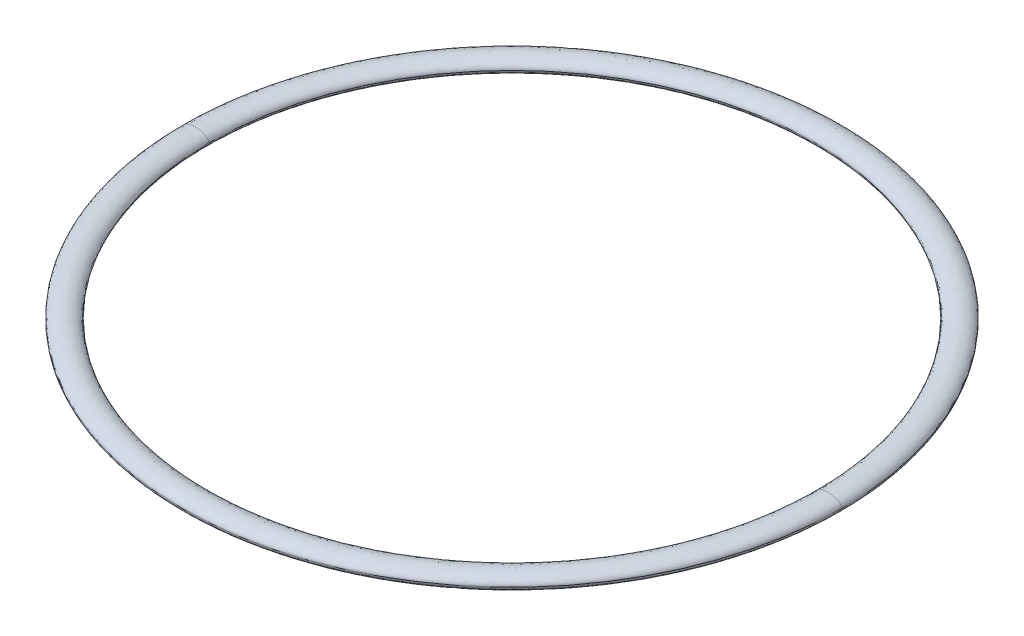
ISO-10303-21;
HEADER;
FILE_DESCRIPTION(('STEP AP214'),'2;1');
FILE_NAME('part.step','',(''),(''),'','','');
FILE_SCHEMA(('AUTOMOTIVE_DESIGN { 1 0 10303 214 1 1 1 1 }'));
ENDSEC;
DATA;
#1=APPLICATION_CONTEXT('core data for automotive mechanical design processes');
#2=APPLICATION_PROTOCOL_DEFINITION('international standard','automotive_design',2000,#1);
#3=PRODUCT_CONTEXT('',#1,'mechanical');
#4=PRODUCT('Part','Part','',(#3));
#5=PRODUCT_RELATED_PRODUCT_CATEGORY('part','',(#4));
#6=PRODUCT_DEFINITION_FORMATION('','',#4);
#7=PRODUCT_DEFINITION_CONTEXT('part definition',#1,'design');
#8=PRODUCT_DEFINITION('design','',#6,#7);
#9=PRODUCT_DEFINITION_SHAPE('','',#8);
#10=(LENGTH_UNIT() NAMED_UNIT(*) SI_UNIT(.MILLI.,.METRE.));
#11=(NAMED_UNIT(*) PLANE_ANGLE_UNIT() SI_UNIT($,.RADIAN.));
#12=(NAMED_UNIT(*) SI_UNIT($,.STERADIAN.) SOLID_ANGLE_UNIT());
#13=UNCERTAINTY_MEASURE_WITH_UNIT(LENGTH_MEASURE(1.E-05),#10,'distance_accuracy_value','');
#14=(GEOMETRIC_REPRESENTATION_CONTEXT(3) GLOBAL_UNCERTAINTY_ASSIGNED_CONTEXT((#13)) GLOBAL_UNIT_ASSIGNED_CONTEXT((#10,
#11,#12)) REPRESENTATION_CONTEXT('',''));
#15=CARTESIAN_POINT('',(0.,0.,0.));
#16=DIRECTION('',(0.,0.,1.));
#17=DIRECTION('',(1.,0.,0.));
#18=AXIS2_PLACEMENT_3D('',#15,#16,#17);
#19=CARTESIAN_POINT('',(31.063768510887,-40.275,0.));
#20=CARTESIAN_POINT('',(31.063768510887,-40.275,62.127537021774));
#21=CARTESIAN_POINT('',(-31.06376851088,-40.275,62.127537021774));
#22=CARTESIAN_POINT('',(-31.06376851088,-40.275,0.));
#23=CARTESIAN_POINT('',(31.063768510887,-41.725,0.));
#24=CARTESIAN_POINT('',(31.063768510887,-41.725,62.127537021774));
#25=CARTESIAN_POINT('',(-31.06376851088,-41.725,62.127537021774));
#26=CARTESIAN_POINT('',(-31.06376851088,-41.725,0.));
#27=CARTESIAN_POINT('',(33.786231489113,-41.725,0.));
#28=CARTESIAN_POINT('',(33.786231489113,-41.725,67.572462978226));
#29=CARTESIAN_POINT('',(-33.78623148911,-41.725,67.572462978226));
#30=CARTESIAN_POINT('',(-33.78623148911,-41.725,0.));
#31=CARTESIAN_POINT('',(33.786231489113,-40.275,0.));
#32=CARTESIAN_POINT('',(33.786231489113,-40.275,67.572462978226));
#33=CARTESIAN_POINT('',(-33.78623148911,-40.275,67.572462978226));
#34=CARTESIAN_POINT('',(-33.78623148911,-40.275,0.));
#35=(BOUNDED_SURFACE() B_SPLINE_SURFACE(3,3,((#19,#20,#21,#22),(#23,#24,#25,#26),(#27,#28,#29,
#30),(#31,#32,#33,#34)),.UNSPECIFIED.,.F.,.F.,.F.) B_SPLINE_SURFACE_WITH_KNOTS((4,4),(4,4),(0.,
1.),(0.,1.),.UNSPECIFIED.) GEOMETRIC_REPRESENTATION_ITEM() RATIONAL_B_SPLINE_SURFACE(((1.,
0.333333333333,0.333333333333,1.),(0.333333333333,0.111111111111,0.111111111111,0.333333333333),
(0.333333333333,0.111111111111,0.111111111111,0.333333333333),(1.,0.333333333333,0.333333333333,1.))) REPRESENTATION_ITEM('') SURFACE());
#36=CARTESIAN_POINT('',(-31.06376851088,-40.275,0.));
#37=CARTESIAN_POINT('',(-31.06376851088,-41.725,0.));
#38=CARTESIAN_POINT('',(-33.78623148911,-41.725,0.));
#39=CARTESIAN_POINT('',(-33.78623148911,-40.275,0.));
#40=(BOUNDED_CURVE() B_SPLINE_CURVE(3,(#36,#37,#38,#39),.UNSPECIFIED.,.F.,
.F.) B_SPLINE_CURVE_WITH_KNOTS((4,4),(3.14159265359,6.28318530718),
.UNSPECIFIED.) CURVE() GEOMETRIC_REPRESENTATION_ITEM() RATIONAL_B_SPLINE_CURVE((1.,
0.333333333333,0.333333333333,1.)) REPRESENTATION_ITEM(''));
#41=CARTESIAN_POINT('',(-31.06376851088,-40.275,0.));
#42=VERTEX_POINT('',#41);
#43=CARTESIAN_POINT('',(-33.78623148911,-40.275,0.));
#44=VERTEX_POINT('',#43);
#45=EDGE_CURVE('E70',#42,#44,#40,.T.);
#46=CARTESIAN_POINT('',(0.,-40.275,0.));
#47=DIRECTION('',(0.,-1.,0.));
#48=DIRECTION('',(1.,0.,0.));
#49=AXIS2_PLACEMENT_3D('',#46,#47,#48);
#50=CIRCLE('',#49,31.063768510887);
#51=CARTESIAN_POINT('',(31.063768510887,-40.275,0.));
#52=VERTEX_POINT('',#51);
#53=EDGE_CURVE('E10',#52,#42,#50,.T.);
#54=CARTESIAN_POINT('',(31.063768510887,-40.275,0.));
#55=CARTESIAN_POINT('',(31.063768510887,-41.725,0.));
#56=CARTESIAN_POINT('',(33.786231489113,-41.725,0.));
#57=CARTESIAN_POINT('',(33.786231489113,-40.275,0.));
#58=(BOUNDED_CURVE() B_SPLINE_CURVE(3,(#54,#55,#56,#57),.UNSPECIFIED.,.F.,
.F.) B_SPLINE_CURVE_WITH_KNOTS((4,4),(3.14159265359,6.28318530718),
.UNSPECIFIED.) CURVE() GEOMETRIC_REPRESENTATION_ITEM() RATIONAL_B_SPLINE_CURVE((1.,
0.333333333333,0.333333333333,1.)) REPRESENTATION_ITEM(''));
#59=CARTESIAN_POINT('',(33.786231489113,-40.275,0.));
#60=VERTEX_POINT('',#59);
#61=EDGE_CURVE('E68',#52,#60,#58,.T.);
#62=CARTESIAN_POINT('',(0.,-40.275,0.));
#63=DIRECTION('',(0.,-1.,0.));
#64=DIRECTION('',(1.,0.,0.));
#65=AXIS2_PLACEMENT_3D('',#62,#63,#64);
#66=CIRCLE('',#65,33.786231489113);
#67=EDGE_CURVE('E28',#60,#44,#66,.T.);
#68=ORIENTED_EDGE('',*,*,#45,.F.);
#69=ORIENTED_EDGE('',*,*,#53,.F.);
#70=ORIENTED_EDGE('',*,*,#61,.T.);
#71=ORIENTED_EDGE('',*,*,#67,.T.);
#72=EDGE_LOOP('',(#68,#69,#70,#71));
#73=FACE_BOUND('',#72,.T.);
#74=ADVANCED_FACE('F16',(#73),#35,.T.);
#75=CARTESIAN_POINT('',(33.786231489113,-40.275,0.));
#76=CARTESIAN_POINT('',(33.786231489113,-40.275,67.572462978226));
#77=CARTESIAN_POINT('',(-33.78623148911,-40.275,67.572462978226));
#78=CARTESIAN_POINT('',(-33.78623148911,-40.275,0.));
#79=CARTESIAN_POINT('',(33.786231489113,-38.825,0.));
#80=CARTESIAN_POINT('',(33.786231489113,-38.825,67.572462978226));
#81=CARTESIAN_POINT('',(-33.78623148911,-38.825,67.572462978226));
#82=CARTESIAN_POINT('',(-33.78623148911,-38.825,0.));
#83=CARTESIAN_POINT('',(31.063768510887,-38.825,0.));
#84=CARTESIAN_POINT('',(31.063768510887,-38.825,62.127537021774));
#85=CARTESIAN_POINT('',(-31.06376851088,-38.825,62.127537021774));
#86=CARTESIAN_POINT('',(-31.06376851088,-38.825,0.));
#87=CARTESIAN_POINT('',(31.063768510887,-40.275,0.));
#88=CARTESIAN_POINT('',(31.063768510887,-40.275,62.127537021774));
#89=CARTESIAN_POINT('',(-31.06376851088,-40.275,62.127537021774));
#90=CARTESIAN_POINT('',(-31.06376851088,-40.275,0.));
#91=(BOUNDED_SURFACE() B_SPLINE_SURFACE(3,3,((#75,#76,#77,#78),(#79,#80,#81,#82),(#83,#84,#85,
#86),(#87,#88,#89,#90)),.UNSPECIFIED.,.F.,.F.,.F.) B_SPLINE_SURFACE_WITH_KNOTS((4,4),(4,4),(0.,
1.),(0.,1.),.UNSPECIFIED.) GEOMETRIC_REPRESENTATION_ITEM() RATIONAL_B_SPLINE_SURFACE(((1.,
0.333333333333,0.333333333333,1.),(0.333333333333,0.111111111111,0.111111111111,0.333333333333),
(0.333333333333,0.111111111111,0.111111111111,0.333333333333),(1.,0.333333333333,0.333333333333,1.))) REPRESENTATION_ITEM('') SURFACE());
#92=CARTESIAN_POINT('',(-33.78623148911,-40.275,0.));
#93=CARTESIAN_POINT('',(-33.78623148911,-38.825,0.));
#94=CARTESIAN_POINT('',(-31.06376851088,-38.825,0.));
#95=CARTESIAN_POINT('',(-31.06376851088,-40.275,0.));
#96=(BOUNDED_CURVE() B_SPLINE_CURVE(3,(#92,#93,#94,#95),.UNSPECIFIED.,.F.,
.F.) B_SPLINE_CURVE_WITH_KNOTS((4,4),(0.,3.14159265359),
.UNSPECIFIED.) CURVE() GEOMETRIC_REPRESENTATION_ITEM() RATIONAL_B_SPLINE_CURVE((1.,
0.333333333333,0.333333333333,1.)) REPRESENTATION_ITEM(''));
#97=EDGE_CURVE('E56',#44,#42,#96,.T.);
#98=CARTESIAN_POINT('',(33.786231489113,-40.275,0.));
#99=CARTESIAN_POINT('',(33.786231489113,-38.825,0.));
#100=CARTESIAN_POINT('',(31.063768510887,-38.825,0.));
#101=CARTESIAN_POINT('',(31.063768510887,-40.275,0.));
#102=(BOUNDED_CURVE() B_SPLINE_CURVE(3,(#98,#99,#100,#101),.UNSPECIFIED.,.F.,
.F.) B_SPLINE_CURVE_WITH_KNOTS((4,4),(0.,3.14159265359),
.UNSPECIFIED.) CURVE() GEOMETRIC_REPRESENTATION_ITEM() RATIONAL_B_SPLINE_CURVE((1.,
0.333333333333,0.333333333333,1.)) REPRESENTATION_ITEM(''));
#103=EDGE_CURVE('E58',#60,#52,#102,.T.);
#104=ORIENTED_EDGE('',*,*,#97,.F.);
#105=ORIENTED_EDGE('',*,*,#67,.F.);
#106=ORIENTED_EDGE('',*,*,#103,.T.);
#107=ORIENTED_EDGE('',*,*,#53,.T.);
#108=EDGE_LOOP('',(#104,#105,#106,#107));
#109=FACE_BOUND('',#108,.T.);
#110=ADVANCED_FACE('F18',(#109),#91,.T.);
#111=CARTESIAN_POINT('',(-33.78623148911,-40.275,0.));
#112=CARTESIAN_POINT('',(-33.78623148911,-40.275,-67.57246297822));
#113=CARTESIAN_POINT('',(33.786231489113,-40.275,-67.57246297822));
#114=CARTESIAN_POINT('',(33.786231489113,-40.275,0.));
#115=CARTESIAN_POINT('',(-33.78623148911,-38.825,0.));
#116=CARTESIAN_POINT('',(-33.78623148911,-38.825,-67.57246297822));
#117=CARTESIAN_POINT('',(33.786231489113,-38.825,-67.57246297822));
#118=CARTESIAN_POINT('',(33.786231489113,-38.825,0.));
#119=CARTESIAN_POINT('',(-31.06376851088,-38.825,0.));
#120=CARTESIAN_POINT('',(-31.06376851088,-38.825,-62.12753702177));
#121=CARTESIAN_POINT('',(31.063768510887,-38.825,-62.12753702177));
#122=CARTESIAN_POINT('',(31.063768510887,-38.825,0.));
#123=CARTESIAN_POINT('',(-31.06376851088,-40.275,0.));
#124=CARTESIAN_POINT('',(-31.06376851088,-40.275,-62.12753702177));
#125=CARTESIAN_POINT('',(31.063768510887,-40.275,-62.12753702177));
#126=CARTESIAN_POINT('',(31.063768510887,-40.275,0.));
#127=(BOUNDED_SURFACE() B_SPLINE_SURFACE(3,3,((#111,#112,#113,#114),(#115,#116,#117,#118),(#119,
#120,#121,#122),(#123,#124,#125,#126)),.UNSPECIFIED.,.F.,.F.,
.F.) B_SPLINE_SURFACE_WITH_KNOTS((4,4),(4,4),(0.,1.),(0.,1.),
.UNSPECIFIED.) GEOMETRIC_REPRESENTATION_ITEM() RATIONAL_B_SPLINE_SURFACE(((1.,0.333333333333,
0.333333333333,1.),(0.333333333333,0.111111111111,0.111111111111,0.333333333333),
(0.333333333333,0.111111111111,0.111111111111,0.333333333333),(1.,0.333333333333,0.333333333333,1.))) REPRESENTATION_ITEM('') SURFACE());
#128=CARTESIAN_POINT('',(0.,-40.275,0.));
#129=DIRECTION('',(0.,-1.,0.));
#130=DIRECTION('',(1.,0.,0.));
#131=AXIS2_PLACEMENT_3D('',#128,#129,#130);
#132=CIRCLE('',#131,33.786231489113);
#133=EDGE_CURVE('E65',#44,#60,#132,.T.);
#134=CARTESIAN_POINT('',(0.,-40.275,0.));
#135=DIRECTION('',(0.,-1.,0.));
#136=DIRECTION('',(1.,0.,0.));
#137=AXIS2_PLACEMENT_3D('',#134,#135,#136);
#138=CIRCLE('',#137,31.063768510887);
#139=EDGE_CURVE('E22',#42,#52,#138,.T.);
#140=ORIENTED_EDGE('',*,*,#133,.F.);
#141=ORIENTED_EDGE('',*,*,#97,.T.);
#142=ORIENTED_EDGE('',*,*,#139,.T.);
#143=ORIENTED_EDGE('',*,*,#103,.F.);
#144=EDGE_LOOP('',(#140,#141,#142,#143));
#145=FACE_BOUND('',#144,.T.);
#146=ADVANCED_FACE('F62',(#145),#127,.T.);
#147=CARTESIAN_POINT('',(-31.06376851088,-40.275,0.));
#148=CARTESIAN_POINT('',(-31.06376851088,-40.275,-62.12753702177));
#149=CARTESIAN_POINT('',(31.063768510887,-40.275,-62.12753702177));
#150=CARTESIAN_POINT('',(31.063768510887,-40.275,0.));
#151=CARTESIAN_POINT('',(-31.06376851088,-41.725,0.));
#152=CARTESIAN_POINT('',(-31.06376851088,-41.725,-62.12753702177));
#153=CARTESIAN_POINT('',(31.063768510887,-41.725,-62.12753702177));
#154=CARTESIAN_POINT('',(31.063768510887,-41.725,0.));
#155=CARTESIAN_POINT('',(-33.78623148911,-41.725,0.));
#156=CARTESIAN_POINT('',(-33.78623148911,-41.725,-67.57246297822));
#157=CARTESIAN_POINT('',(33.786231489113,-41.725,-67.57246297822));
#158=CARTESIAN_POINT('',(33.786231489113,-41.725,0.));
#159=CARTESIAN_POINT('',(-33.78623148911,-40.275,0.));
#160=CARTESIAN_POINT('',(-33.78623148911,-40.275,-67.57246297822));
#161=CARTESIAN_POINT('',(33.786231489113,-40.275,-67.57246297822));
#162=CARTESIAN_POINT('',(33.786231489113,-40.275,0.));
#163=(BOUNDED_SURFACE() B_SPLINE_SURFACE(3,3,((#147,#148,#149,#150),(#151,#152,#153,#154),(#155,
#156,#157,#158),(#159,#160,#161,#162)),.UNSPECIFIED.,.F.,.F.,
.F.) B_SPLINE_SURFACE_WITH_KNOTS((4,4),(4,4),(0.,1.),(0.,1.),
.UNSPECIFIED.) GEOMETRIC_REPRESENTATION_ITEM() RATIONAL_B_SPLINE_SURFACE(((1.,0.333333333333,
0.333333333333,1.),(0.333333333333,0.111111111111,0.111111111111,0.333333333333),
(0.333333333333,0.111111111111,0.111111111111,0.333333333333),(1.,0.333333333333,0.333333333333,1.))) REPRESENTATION_ITEM('') SURFACE());
#164=ORIENTED_EDGE('',*,*,#139,.F.);
#165=ORIENTED_EDGE('',*,*,#45,.T.);
#166=ORIENTED_EDGE('',*,*,#133,.T.);
#167=ORIENTED_EDGE('',*,*,#61,.F.);
#168=EDGE_LOOP('',(#164,#165,#166,#167));
#169=FACE_BOUND('',#168,.T.);
#170=ADVANCED_FACE('F74',(#169),#163,.T.);
#171=CLOSED_SHELL('',(#74,#110,#146,#170));
#172=MANIFOLD_SOLID_BREP('B1',#171);
#173=ADVANCED_BREP_SHAPE_REPRESENTATION('',(#18,#172),#14);
#174=SHAPE_DEFINITION_REPRESENTATION(#9,#173);
ENDSEC;
END-ISO-10303-21;
